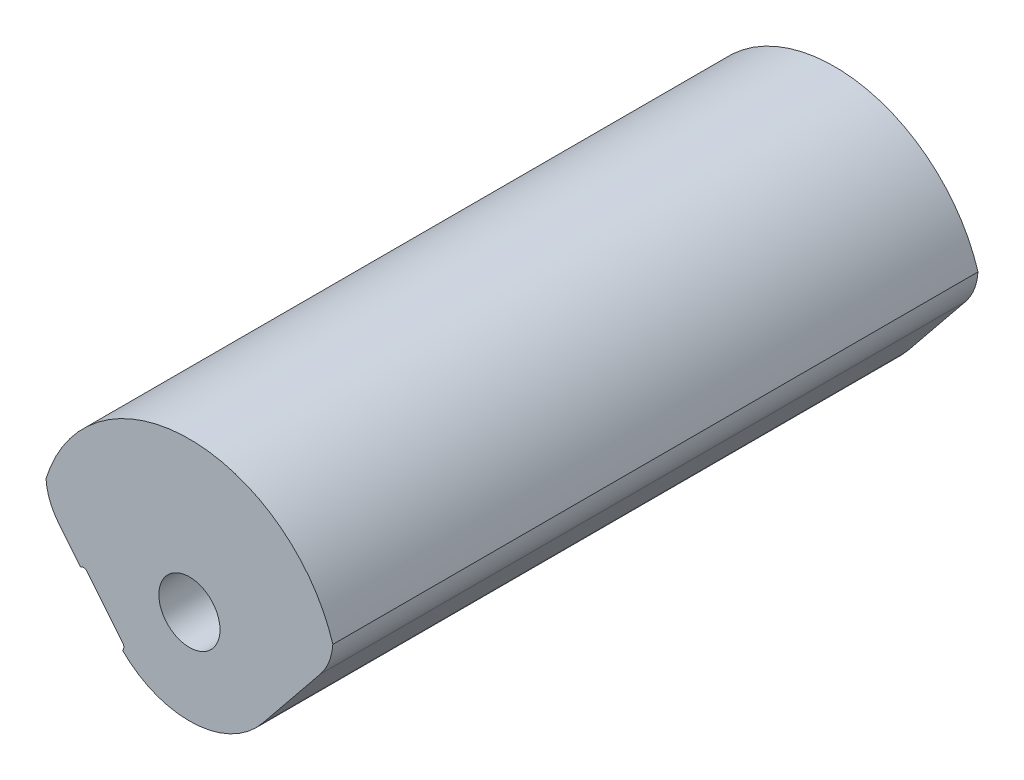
ISO-10303-21;
HEADER;
FILE_DESCRIPTION(('STEP AP214'),'2;1');
FILE_NAME('part.step','',(''),(''),'','','');
FILE_SCHEMA(('AUTOMOTIVE_DESIGN { 1 0 10303 214 1 1 1 1 }'));
ENDSEC;
DATA;
#1=APPLICATION_CONTEXT('core data for automotive mechanical design processes');
#2=APPLICATION_PROTOCOL_DEFINITION('international standard','automotive_design',2000,#1);
#3=PRODUCT_CONTEXT('',#1,'mechanical');
#4=PRODUCT('Part','Part','',(#3));
#5=PRODUCT_RELATED_PRODUCT_CATEGORY('part','',(#4));
#6=PRODUCT_DEFINITION_FORMATION('','',#4);
#7=PRODUCT_DEFINITION_CONTEXT('part definition',#1,'design');
#8=PRODUCT_DEFINITION('design','',#6,#7);
#9=PRODUCT_DEFINITION_SHAPE('','',#8);
#10=(LENGTH_UNIT() NAMED_UNIT(*) SI_UNIT(.MILLI.,.METRE.));
#11=(NAMED_UNIT(*) PLANE_ANGLE_UNIT() SI_UNIT($,.RADIAN.));
#12=(NAMED_UNIT(*) SI_UNIT($,.STERADIAN.) SOLID_ANGLE_UNIT());
#13=UNCERTAINTY_MEASURE_WITH_UNIT(LENGTH_MEASURE(1.E-05),#10,'distance_accuracy_value','');
#14=(GEOMETRIC_REPRESENTATION_CONTEXT(3) GLOBAL_UNCERTAINTY_ASSIGNED_CONTEXT((#13)) GLOBAL_UNIT_ASSIGNED_CONTEXT((#10,
#11,#12)) REPRESENTATION_CONTEXT('',''));
#15=CARTESIAN_POINT('',(0.,0.,0.));
#16=DIRECTION('',(0.,0.,1.));
#17=DIRECTION('',(1.,0.,0.));
#18=AXIS2_PLACEMENT_3D('',#15,#16,#17);
#19=CARTESIAN_POINT('',(0.,0.,8.));
#20=DIRECTION('',(0.,0.,1.));
#21=DIRECTION('',(1.,0.,0.));
#22=AXIS2_PLACEMENT_3D('',#19,#20,#21);
#23=PLANE('',#22);
#24=CARTESIAN_POINT('',(0.,0.,8.));
#25=DIRECTION('',(0.,0.,1.));
#26=DIRECTION('',(1.,0.,0.));
#27=AXIS2_PLACEMENT_3D('',#24,#25,#26);
#28=CIRCLE('',#27,2.5);
#29=CARTESIAN_POINT('',(2.5,0.,8.));
#30=VERTEX_POINT('',#29);
#31=EDGE_CURVE('E20',#30,#30,#28,.F.);
#32=ORIENTED_EDGE('',*,*,#31,.T.);
#33=EDGE_LOOP('',(#32));
#34=FACE_BOUND('',#33,.T.);
#35=ADVANCED_FACE('F17',(#34),#23,.F.);
#36=CARTESIAN_POINT('',(0.,0.,0.));
#37=DIRECTION('',(0.,0.,1.));
#38=DIRECTION('',(1.,0.,0.));
#39=AXIS2_PLACEMENT_3D('',#36,#37,#38);
#40=CYLINDRICAL_SURFACE('',#39,2.5);
#41=ORIENTED_EDGE('',*,*,#31,.F.);
#42=EDGE_LOOP('',(#41));
#43=FACE_BOUND('',#42,.T.);
#44=CARTESIAN_POINT('',(0.,0.,1.2));
#45=DIRECTION('',(0.,0.,1.));
#46=DIRECTION('',(1.,0.,0.));
#47=AXIS2_PLACEMENT_3D('',#44,#45,#46);
#48=CIRCLE('',#47,2.5);
#49=CARTESIAN_POINT('',(2.5,0.,1.2));
#50=VERTEX_POINT('',#49);
#51=EDGE_CURVE('E100',#50,#50,#48,.T.);
#52=ORIENTED_EDGE('',*,*,#51,.F.);
#53=EDGE_LOOP('',(#52));
#54=FACE_BOUND('',#53,.T.);
#55=ADVANCED_FACE('F226',(#43,#54),#40,.F.);
#56=CARTESIAN_POINT('',(0.,0.,1.2));
#57=DIRECTION('',(0.,0.,-1.));
#58=DIRECTION('',(-1.,0.,0.));
#59=AXIS2_PLACEMENT_3D('',#56,#57,#58);
#60=PLANE('',#59);
#61=ORIENTED_EDGE('',*,*,#51,.T.);
#62=EDGE_LOOP('',(#61));
#63=FACE_BOUND('',#62,.T.);
#64=CARTESIAN_POINT('',(0.,0.,1.2));
#65=DIRECTION('',(0.,0.,1.));
#66=DIRECTION('',(1.,0.,0.));
#67=AXIS2_PLACEMENT_3D('',#64,#65,#66);
#68=CIRCLE('',#67,2.75);
#69=CARTESIAN_POINT('',(2.75,0.,1.2));
#70=VERTEX_POINT('',#69);
#71=EDGE_CURVE('E161',#70,#70,#68,.F.);
#72=ORIENTED_EDGE('',*,*,#71,.T.);
#73=EDGE_LOOP('',(#72));
#74=FACE_BOUND('',#73,.T.);
#75=ADVANCED_FACE('F229',(#63,#74),#60,.T.);
#76=CARTESIAN_POINT('',(0.,0.,24.2000000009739));
#77=DIRECTION('',(0.,0.,1.));
#78=DIRECTION('',(1.,0.,0.));
#79=AXIS2_PLACEMENT_3D('',#76,#77,#78);
#80=CONICAL_SURFACE('',#79,1.62099999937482,1.02974425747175);
#81=CARTESIAN_POINT('',(-5.6843418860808E-11,0.,23.2260049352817));
#82=VERTEX_POINT('',#81);
#83=VERTEX_LOOP('',#82);
#84=FACE_BOUND('',#83,.T.);
#85=CARTESIAN_POINT('',(0.,0.,24.2));
#86=DIRECTION('',(0.,0.,1.));
#87=DIRECTION('',(1.,0.,0.));
#88=AXIS2_PLACEMENT_3D('',#85,#86,#87);
#89=CIRCLE('',#88,1.621);
#90=CARTESIAN_POINT('',(1.621,0.,24.2));
#91=VERTEX_POINT('',#90);
#92=EDGE_CURVE('E109',#91,#91,#89,.T.);
#93=ORIENTED_EDGE('',*,*,#92,.T.);
#94=EDGE_LOOP('',(#93));
#95=FACE_BOUND('',#94,.T.);
#96=ADVANCED_FACE('F235',(#84,#95),#80,.F.);
#97=CARTESIAN_POINT('',(-5.61708966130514,-1.0085505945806,0.));
#98=DIRECTION('',(0.,0.,1.));
#99=DIRECTION('',(1.,0.,0.));
#100=AXIS2_PLACEMENT_3D('',#97,#98,#99);
#101=CYLINDRICAL_SURFACE('',#100,0.250000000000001);
#102=DIRECTION('',(0.,0.,1.));
#103=VECTOR('',#102,1.);
#104=CARTESIAN_POINT('',(-5.7744197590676,-0.814264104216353,0.));
#105=LINE('',#104,#103);
#106=CARTESIAN_POINT('',(-5.7744197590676,-0.814264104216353,0.));
#107=VERTEX_POINT('',#106);
#108=CARTESIAN_POINT('',(-5.7744197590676,-0.814264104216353,34.2));
#109=VERTEX_POINT('',#108);
#110=EDGE_CURVE('E103',#107,#109,#105,.T.);
#111=ORIENTED_EDGE('',*,*,#110,.F.);
#112=CARTESIAN_POINT('',(-5.61708966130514,-1.0085505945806,0.));
#113=DIRECTION('',(0.,0.,1.));
#114=DIRECTION('',(1.,0.,0.));
#115=AXIS2_PLACEMENT_3D('',#112,#113,#114);
#116=CIRCLE('',#115,0.250000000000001);
#117=CARTESIAN_POINT('',(-5.4228031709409,-0.851220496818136,0.));
#118=VERTEX_POINT('',#117);
#119=EDGE_CURVE('E88',#118,#107,#116,.T.);
#120=ORIENTED_EDGE('',*,*,#119,.F.);
#121=DIRECTION('',(0.,0.,1.));
#122=VECTOR('',#121,1.);
#123=CARTESIAN_POINT('',(-5.4228031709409,-0.851220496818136,0.));
#124=LINE('',#123,#122);
#125=CARTESIAN_POINT('',(-5.4228031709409,-0.851220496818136,34.2));
#126=VERTEX_POINT('',#125);
#127=EDGE_CURVE('E108',#126,#118,#124,.F.);
#128=ORIENTED_EDGE('',*,*,#127,.F.);
#129=CARTESIAN_POINT('',(-5.61708966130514,-1.0085505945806,34.2));
#130=DIRECTION('',(0.,0.,1.));
#131=DIRECTION('',(1.,0.,0.));
#132=AXIS2_PLACEMENT_3D('',#129,#130,#131);
#133=CIRCLE('',#132,0.250000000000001);
#134=EDGE_CURVE('E99',#109,#126,#133,.F.);
#135=ORIENTED_EDGE('',*,*,#134,.F.);
#136=EDGE_LOOP('',(#111,#120,#128,#135));
#137=FACE_BOUND('',#136,.T.);
#138=ADVANCED_FACE('F104',(#137),#101,.F.);
#139=CARTESIAN_POINT('',(-3.7283997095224,-3.34088844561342,0.));
#140=DIRECTION('',(0.,0.,1.));
#141=DIRECTION('',(1.,0.,0.));
#142=AXIS2_PLACEMENT_3D('',#139,#140,#141);
#143=CYLINDRICAL_SURFACE('',#142,0.250000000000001);
#144=DIRECTION('',(0.,0.,1.));
#145=VECTOR('',#144,1.);
#146=CARTESIAN_POINT('',(-3.53411321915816,-3.18355834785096,0.));
#147=LINE('',#146,#145);
#148=CARTESIAN_POINT('',(-3.53411321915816,-3.18355834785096,0.));
#149=VERTEX_POINT('',#148);
#150=CARTESIAN_POINT('',(-3.53411321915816,-3.18355834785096,34.2));
#151=VERTEX_POINT('',#150);
#152=EDGE_CURVE('E153',#149,#151,#147,.T.);
#153=ORIENTED_EDGE('',*,*,#152,.F.);
#154=CARTESIAN_POINT('',(-3.7283997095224,-3.34088844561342,0.));
#155=DIRECTION('',(0.,0.,1.));
#156=DIRECTION('',(1.,0.,0.));
#157=AXIS2_PLACEMENT_3D('',#154,#155,#156);
#158=CIRCLE('',#157,0.250000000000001);
#159=CARTESIAN_POINT('',(-3.55247410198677,-3.51851215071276,0.));
#160=VERTEX_POINT('',#159);
#161=EDGE_CURVE('E217',#160,#149,#158,.T.);
#162=ORIENTED_EDGE('',*,*,#161,.F.);
#163=DIRECTION('',(0.,0.,1.));
#164=VECTOR('',#163,1.);
#165=CARTESIAN_POINT('',(-3.55247410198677,-3.51851215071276,0.));
#166=LINE('',#165,#164);
#167=CARTESIAN_POINT('',(-3.55247410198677,-3.51851215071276,34.2));
#168=VERTEX_POINT('',#167);
#169=EDGE_CURVE('E150',#168,#160,#166,.F.);
#170=ORIENTED_EDGE('',*,*,#169,.F.);
#171=CARTESIAN_POINT('',(-3.7283997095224,-3.34088844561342,34.2));
#172=DIRECTION('',(0.,0.,1.));
#173=DIRECTION('',(1.,0.,0.));
#174=AXIS2_PLACEMENT_3D('',#171,#172,#173);
#175=CIRCLE('',#174,0.250000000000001);
#176=EDGE_CURVE('E215',#151,#168,#175,.F.);
#177=ORIENTED_EDGE('',*,*,#176,.F.);
#178=EDGE_LOOP('',(#153,#162,#170,#177));
#179=FACE_BOUND('',#178,.T.);
#180=ADVANCED_FACE('F175',(#179),#143,.F.);
#181=CARTESIAN_POINT('',(0.,0.,1.));
#182=DIRECTION('',(0.,0.,-1.));
#183=DIRECTION('',(-1.,0.,0.));
#184=AXIS2_PLACEMENT_3D('',#181,#182,#183);
#185=TOROIDAL_SURFACE('',#184,2.75,0.2);
#186=CARTESIAN_POINT('',(0.,0.,1.));
#187=DIRECTION('',(0.,0.,1.));
#188=DIRECTION('',(1.,0.,0.));
#189=AXIS2_PLACEMENT_3D('',#186,#187,#188);
#190=CIRCLE('',#189,2.95);
#191=CARTESIAN_POINT('',(2.95,0.,1.));
#192=VERTEX_POINT('',#191);
#193=EDGE_CURVE('E139',#192,#192,#190,.F.);
#194=ORIENTED_EDGE('',*,*,#193,.T.);
#195=EDGE_LOOP('',(#194));
#196=FACE_BOUND('',#195,.T.);
#197=ORIENTED_EDGE('',*,*,#71,.F.);
#198=EDGE_LOOP('',(#197));
#199=FACE_BOUND('',#198,.T.);
#200=ADVANCED_FACE('F169',(#196,#199),#185,.F.);
#201=CARTESIAN_POINT('',(4.25,5.1,0.51));
#202=DIRECTION('',(0.,0.,-1.));
#203=DIRECTION('',(-1.,0.,0.));
#204=AXIS2_PLACEMENT_3D('',#201,#202,#203);
#205=PLANE('',#204);
#206=CARTESIAN_POINT('',(4.25,5.1,0.51));
#207=DIRECTION('',(0.,0.,1.));
#208=DIRECTION('',(1.,0.,0.));
#209=AXIS2_PLACEMENT_3D('',#206,#207,#208);
#210=CIRCLE('',#209,0.5);
#211=CARTESIAN_POINT('',(4.75,5.1,0.51));
#212=VERTEX_POINT('',#211);
#213=EDGE_CURVE('E142',#212,#212,#210,.F.);
#214=ORIENTED_EDGE('',*,*,#213,.T.);
#215=EDGE_LOOP('',(#214));
#216=FACE_BOUND('',#215,.T.);
#217=ADVANCED_FACE('F174',(#216),#205,.T.);
#218=CARTESIAN_POINT('',(4.25,-0.7,0.51));
#219=DIRECTION('',(0.,0.,-1.));
#220=DIRECTION('',(-1.,0.,0.));
#221=AXIS2_PLACEMENT_3D('',#218,#219,#220);
#222=PLANE('',#221);
#223=CARTESIAN_POINT('',(4.25,-0.7,0.51));
#224=DIRECTION('',(0.,0.,1.));
#225=DIRECTION('',(1.,0.,0.));
#226=AXIS2_PLACEMENT_3D('',#223,#224,#225);
#227=CIRCLE('',#226,0.5);
#228=CARTESIAN_POINT('',(4.75,-0.7,0.51));
#229=VERTEX_POINT('',#228);
#230=EDGE_CURVE('E158',#229,#229,#227,.F.);
#231=ORIENTED_EDGE('',*,*,#230,.T.);
#232=EDGE_LOOP('',(#231));
#233=FACE_BOUND('',#232,.T.);
#234=ADVANCED_FACE('F286',(#233),#222,.T.);
#235=CARTESIAN_POINT('',(0.,0.,29.2));
#236=DIRECTION('',(0.,0.,1.));
#237=DIRECTION('',(1.,0.,0.));
#238=AXIS2_PLACEMENT_3D('',#235,#236,#237);
#239=CYLINDRICAL_SURFACE('',#238,1.621);
#240=ORIENTED_EDGE('',*,*,#92,.F.);
#241=EDGE_LOOP('',(#240));
#242=FACE_BOUND('',#241,.T.);
#243=CARTESIAN_POINT('',(0.,0.,34.2));
#244=DIRECTION('',(0.,0.,1.));
#245=DIRECTION('',(1.,0.,0.));
#246=AXIS2_PLACEMENT_3D('',#243,#244,#245);
#247=CIRCLE('',#246,1.621);
#248=CARTESIAN_POINT('',(1.621,0.,34.2));
#249=VERTEX_POINT('',#248);
#250=EDGE_CURVE('E131',#249,#249,#247,.F.);
#251=ORIENTED_EDGE('',*,*,#250,.F.);
#252=EDGE_LOOP('',(#251));
#253=FACE_BOUND('',#252,.T.);
#254=ADVANCED_FACE('F284',(#242,#253),#239,.F.);
#255=CARTESIAN_POINT('',(-5.7744197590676,-0.814264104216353,0.));
#256=DIRECTION('',(-0.77714596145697,-0.629320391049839,0.));
#257=DIRECTION('',(0.629320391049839,-0.77714596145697,0.));
#258=AXIS2_PLACEMENT_3D('',#255,#256,#257);
#259=PLANE('',#258);
#260=DIRECTION('',(0.629320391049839,-0.77714596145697,0.));
#261=VECTOR('',#260,1.);
#262=CARTESIAN_POINT('',(-6.94052773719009,0.625759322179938,0.));
#263=LINE('',#262,#261);
#264=CARTESIAN_POINT('',(-6.94052773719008,0.625759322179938,0.));
#265=VERTEX_POINT('',#264);
#266=EDGE_CURVE('E96',#265,#107,#263,.T.);
#267=ORIENTED_EDGE('',*,*,#266,.T.);
#268=ORIENTED_EDGE('',*,*,#110,.T.);
#269=DIRECTION('',(0.629320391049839,-0.77714596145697,0.));
#270=VECTOR('',#269,1.);
#271=CARTESIAN_POINT('',(-6.94052773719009,0.625759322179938,34.2));
#272=LINE('',#271,#270);
#273=CARTESIAN_POINT('',(-6.94052773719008,0.625759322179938,34.2));
#274=VERTEX_POINT('',#273);
#275=EDGE_CURVE('E136',#274,#109,#272,.T.);
#276=ORIENTED_EDGE('',*,*,#275,.F.);
#277=DIRECTION('',(0.,0.,1.));
#278=VECTOR('',#277,1.);
#279=CARTESIAN_POINT('',(-6.94052773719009,0.625759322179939,0.));
#280=LINE('',#279,#278);
#281=EDGE_CURVE('E112',#265,#274,#280,.T.);
#282=ORIENTED_EDGE('',*,*,#281,.F.);
#283=EDGE_LOOP('',(#267,#268,#276,#282));
#284=FACE_BOUND('',#283,.T.);
#285=ADVANCED_FACE('F111',(#284),#259,.T.);
#286=CARTESIAN_POINT('',(-3.53411321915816,-3.18355834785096,0.));
#287=DIRECTION('',(-0.77714596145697,-0.629320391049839,0.));
#288=DIRECTION('',(0.629320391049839,-0.77714596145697,0.));
#289=AXIS2_PLACEMENT_3D('',#286,#287,#288);
#290=PLANE('',#289);
#291=DIRECTION('',(0.629320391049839,-0.77714596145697,0.));
#292=VECTOR('',#291,1.);
#293=CARTESIAN_POINT('',(-5.4228031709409,-0.851220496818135,0.));
#294=LINE('',#293,#292);
#295=EDGE_CURVE('E98',#118,#149,#294,.T.);
#296=ORIENTED_EDGE('',*,*,#295,.T.);
#297=ORIENTED_EDGE('',*,*,#152,.T.);
#298=DIRECTION('',(0.629320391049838,-0.77714596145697,0.));
#299=VECTOR('',#298,1.);
#300=CARTESIAN_POINT('',(-5.4228031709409,-0.851220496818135,34.2));
#301=LINE('',#300,#299);
#302=EDGE_CURVE('E133',#126,#151,#301,.T.);
#303=ORIENTED_EDGE('',*,*,#302,.F.);
#304=ORIENTED_EDGE('',*,*,#127,.T.);
#305=EDGE_LOOP('',(#296,#297,#303,#304));
#306=FACE_BOUND('',#305,.T.);
#307=ADVANCED_FACE('F277',(#306),#290,.T.);
#308=CARTESIAN_POINT('',(0.,0.,0.));
#309=DIRECTION('',(0.,0.,1.));
#310=DIRECTION('',(1.,0.,0.));
#311=AXIS2_PLACEMENT_3D('',#308,#309,#310);
#312=CYLINDRICAL_SURFACE('',#311,5.);
#313=CARTESIAN_POINT('',(0.,0.,0.));
#314=DIRECTION('',(0.,0.,1.));
#315=DIRECTION('',(1.,0.,0.));
#316=AXIS2_PLACEMENT_3D('',#313,#314,#315);
#317=CIRCLE('',#316,5.);
#318=CARTESIAN_POINT('',(3.88572980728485,-3.14660195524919,0.));
#319=VERTEX_POINT('',#318);
#320=EDGE_CURVE('E116',#160,#319,#317,.T.);
#321=ORIENTED_EDGE('',*,*,#320,.T.);
#322=DIRECTION('',(0.,0.,1.));
#323=VECTOR('',#322,1.);
#324=CARTESIAN_POINT('',(3.88572980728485,-3.14660195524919,0.));
#325=LINE('',#324,#323);
#326=CARTESIAN_POINT('',(3.88572980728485,-3.14660195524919,34.2));
#327=VERTEX_POINT('',#326);
#328=EDGE_CURVE('E143',#327,#319,#325,.F.);
#329=ORIENTED_EDGE('',*,*,#328,.F.);
#330=CARTESIAN_POINT('',(0.,0.,34.2));
#331=DIRECTION('',(0.,0.,1.));
#332=DIRECTION('',(1.,0.,0.));
#333=AXIS2_PLACEMENT_3D('',#330,#331,#332);
#334=CIRCLE('',#333,5.);
#335=EDGE_CURVE('E132',#168,#327,#334,.T.);
#336=ORIENTED_EDGE('',*,*,#335,.F.);
#337=ORIENTED_EDGE('',*,*,#169,.T.);
#338=EDGE_LOOP('',(#321,#329,#336,#337));
#339=FACE_BOUND('',#338,.T.);
#340=ADVANCED_FACE('F273',(#339),#312,.T.);
#341=CARTESIAN_POINT('',(6.94052773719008,0.625759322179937,0.));
#342=DIRECTION('',(0.777145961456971,-0.629320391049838,0.));
#343=DIRECTION('',(0.629320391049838,0.777145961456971,0.));
#344=AXIS2_PLACEMENT_3D('',#341,#342,#343);
#345=PLANE('',#344);
#346=DIRECTION('',(0.629320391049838,0.777145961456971,0.));
#347=VECTOR('',#346,1.);
#348=CARTESIAN_POINT('',(3.88572980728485,-3.14660195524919,0.));
#349=LINE('',#348,#347);
#350=CARTESIAN_POINT('',(6.94052773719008,0.625759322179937,0.));
#351=VERTEX_POINT('',#350);
#352=EDGE_CURVE('E201',#319,#351,#349,.T.);
#353=ORIENTED_EDGE('',*,*,#352,.T.);
#354=DIRECTION('',(0.,0.,1.));
#355=VECTOR('',#354,1.);
#356=CARTESIAN_POINT('',(6.94052773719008,0.625759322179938,0.));
#357=LINE('',#356,#355);
#358=CARTESIAN_POINT('',(6.94052773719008,0.625759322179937,34.2));
#359=VERTEX_POINT('',#358);
#360=EDGE_CURVE('E118',#359,#351,#357,.F.);
#361=ORIENTED_EDGE('',*,*,#360,.F.);
#362=DIRECTION('',(0.629320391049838,0.777145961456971,0.));
#363=VECTOR('',#362,1.);
#364=CARTESIAN_POINT('',(3.88572980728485,-3.14660195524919,34.2));
#365=LINE('',#364,#363);
#366=EDGE_CURVE('E129',#327,#359,#365,.T.);
#367=ORIENTED_EDGE('',*,*,#366,.F.);
#368=ORIENTED_EDGE('',*,*,#328,.T.);
#369=EDGE_LOOP('',(#353,#361,#367,#368));
#370=FACE_BOUND('',#369,.T.);
#371=ADVANCED_FACE('F269',(#370),#345,.T.);
#372=CARTESIAN_POINT('',(0.,0.,0.));
#373=DIRECTION('',(0.,0.,1.));
#374=DIRECTION('',(1.,0.,0.));
#375=AXIS2_PLACEMENT_3D('',#372,#373,#374);
#376=CYLINDRICAL_SURFACE('',#375,2.95);
#377=ORIENTED_EDGE('',*,*,#193,.F.);
#378=EDGE_LOOP('',(#377));
#379=FACE_BOUND('',#378,.T.);
#380=CARTESIAN_POINT('',(0.,0.,0.));
#381=DIRECTION('',(0.,0.,1.));
#382=DIRECTION('',(1.,0.,0.));
#383=AXIS2_PLACEMENT_3D('',#380,#381,#382);
#384=CIRCLE('',#383,2.95);
#385=CARTESIAN_POINT('',(2.95,0.,0.));
#386=VERTEX_POINT('',#385);
#387=EDGE_CURVE('E197',#386,#386,#384,.F.);
#388=ORIENTED_EDGE('',*,*,#387,.T.);
#389=EDGE_LOOP('',(#388));
#390=FACE_BOUND('',#389,.T.);
#391=ADVANCED_FACE('F265',(#379,#390),#376,.F.);
#392=CARTESIAN_POINT('',(4.25,5.1,0.));
#393=DIRECTION('',(0.,0.,1.));
#394=DIRECTION('',(1.,0.,0.));
#395=AXIS2_PLACEMENT_3D('',#392,#393,#394);
#396=CYLINDRICAL_SURFACE('',#395,0.5);
#397=CARTESIAN_POINT('',(4.25,5.1,0.));
#398=DIRECTION('',(0.,0.,1.));
#399=DIRECTION('',(1.,0.,0.));
#400=AXIS2_PLACEMENT_3D('',#397,#398,#399);
#401=CIRCLE('',#400,0.5);
#402=CARTESIAN_POINT('',(4.75,5.1,0.));
#403=VERTEX_POINT('',#402);
#404=EDGE_CURVE('E194',#403,#403,#401,.F.);
#405=ORIENTED_EDGE('',*,*,#404,.T.);
#406=EDGE_LOOP('',(#405));
#407=FACE_BOUND('',#406,.T.);
#408=ORIENTED_EDGE('',*,*,#213,.F.);
#409=EDGE_LOOP('',(#408));
#410=FACE_BOUND('',#409,.T.);
#411=ADVANCED_FACE('F261',(#407,#410),#396,.F.);
#412=CARTESIAN_POINT('',(4.25,-0.7,0.));
#413=DIRECTION('',(0.,0.,1.));
#414=DIRECTION('',(1.,0.,0.));
#415=AXIS2_PLACEMENT_3D('',#412,#413,#414);
#416=CYLINDRICAL_SURFACE('',#415,0.5);
#417=CARTESIAN_POINT('',(4.25,-0.7,0.));
#418=DIRECTION('',(0.,0.,1.));
#419=DIRECTION('',(1.,0.,0.));
#420=AXIS2_PLACEMENT_3D('',#417,#418,#419);
#421=CIRCLE('',#420,0.5);
#422=CARTESIAN_POINT('',(4.75,-0.7,0.));
#423=VERTEX_POINT('',#422);
#424=EDGE_CURVE('E128',#423,#423,#421,.F.);
#425=ORIENTED_EDGE('',*,*,#424,.T.);
#426=EDGE_LOOP('',(#425));
#427=FACE_BOUND('',#426,.T.);
#428=ORIENTED_EDGE('',*,*,#230,.F.);
#429=EDGE_LOOP('',(#428));
#430=FACE_BOUND('',#429,.T.);
#431=ADVANCED_FACE('F257',(#427,#430),#416,.F.);
#432=CARTESIAN_POINT('',(-4.60908985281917,2.51372049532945,0.));
#433=DIRECTION('',(0.,0.,1.));
#434=DIRECTION('',(1.,0.,0.));
#435=AXIS2_PLACEMENT_3D('',#432,#433,#434);
#436=CYLINDRICAL_SURFACE('',#435,3.);
#437=CARTESIAN_POINT('',(-4.60908985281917,2.51372049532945,0.));
#438=DIRECTION('',(0.,0.,1.));
#439=DIRECTION('',(1.,0.,0.));
#440=AXIS2_PLACEMENT_3D('',#437,#438,#439);
#441=CIRCLE('',#440,3.);
#442=CARTESIAN_POINT('',(-7.60302402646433,2.32304232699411,0.));
#443=VERTEX_POINT('',#442);
#444=EDGE_CURVE('E114',#443,#265,#441,.T.);
#445=ORIENTED_EDGE('',*,*,#444,.T.);
#446=ORIENTED_EDGE('',*,*,#281,.T.);
#447=CARTESIAN_POINT('',(-4.60908985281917,2.51372049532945,34.2));
#448=DIRECTION('',(0.,0.,1.));
#449=DIRECTION('',(1.,0.,0.));
#450=AXIS2_PLACEMENT_3D('',#447,#448,#449);
#451=CIRCLE('',#450,3.);
#452=CARTESIAN_POINT('',(-7.60302402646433,2.32304232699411,34.2));
#453=VERTEX_POINT('',#452);
#454=EDGE_CURVE('E138',#453,#274,#451,.T.);
#455=ORIENTED_EDGE('',*,*,#454,.F.);
#456=DIRECTION('',(0.,0.,1.));
#457=VECTOR('',#456,1.);
#458=CARTESIAN_POINT('',(-7.60302402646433,2.32304232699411,0.));
#459=LINE('',#458,#457);
#460=EDGE_CURVE('E125',#443,#453,#459,.T.);
#461=ORIENTED_EDGE('',*,*,#460,.F.);
#462=EDGE_LOOP('',(#445,#446,#455,#461));
#463=FACE_BOUND('',#462,.T.);
#464=ADVANCED_FACE('F253',(#463),#436,.T.);
#465=CARTESIAN_POINT('',(0.,1.475,34.2));
#466=DIRECTION('',(0.,0.,1.));
#467=DIRECTION('',(1.,0.,0.));
#468=AXIS2_PLACEMENT_3D('',#465,#466,#467);
#469=PLANE('',#468);
#470=ORIENTED_EDGE('',*,*,#250,.T.);
#471=EDGE_LOOP('',(#470));
#472=FACE_BOUND('',#471,.T.);
#473=ORIENTED_EDGE('',*,*,#335,.T.);
#474=ORIENTED_EDGE('',*,*,#366,.T.);
#475=CARTESIAN_POINT('',(4.60908985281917,2.51372049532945,34.2));
#476=DIRECTION('',(0.,0.,1.));
#477=DIRECTION('',(1.,0.,0.));
#478=AXIS2_PLACEMENT_3D('',#475,#476,#477);
#479=CIRCLE('',#478,3.);
#480=CARTESIAN_POINT('',(7.60302402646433,2.32304232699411,34.2));
#481=VERTEX_POINT('',#480);
#482=EDGE_CURVE('E147',#481,#359,#479,.F.);
#483=ORIENTED_EDGE('',*,*,#482,.F.);
#484=CARTESIAN_POINT('',(0.,0.,34.2));
#485=DIRECTION('',(0.,0.,1.));
#486=DIRECTION('',(1.,0.,0.));
#487=AXIS2_PLACEMENT_3D('',#484,#485,#486);
#488=CIRCLE('',#487,7.95);
#489=EDGE_CURVE('E124',#453,#481,#488,.F.);
#490=ORIENTED_EDGE('',*,*,#489,.F.);
#491=ORIENTED_EDGE('',*,*,#454,.T.);
#492=ORIENTED_EDGE('',*,*,#275,.T.);
#493=ORIENTED_EDGE('',*,*,#134,.T.);
#494=ORIENTED_EDGE('',*,*,#302,.T.);
#495=ORIENTED_EDGE('',*,*,#176,.T.);
#496=EDGE_LOOP('',(#473,#474,#483,#490,#491,#492,#493,#494,#495));
#497=FACE_BOUND('',#496,.T.);
#498=ADVANCED_FACE('F250',(#472,#497),#469,.T.);
#499=CARTESIAN_POINT('',(4.60908985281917,2.51372049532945,0.));
#500=DIRECTION('',(0.,0.,1.));
#501=DIRECTION('',(1.,0.,0.));
#502=AXIS2_PLACEMENT_3D('',#499,#500,#501);
#503=CYLINDRICAL_SURFACE('',#502,3.);
#504=CARTESIAN_POINT('',(4.60908985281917,2.51372049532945,0.));
#505=DIRECTION('',(0.,0.,1.));
#506=DIRECTION('',(1.,0.,0.));
#507=AXIS2_PLACEMENT_3D('',#504,#505,#506);
#508=CIRCLE('',#507,3.);
#509=CARTESIAN_POINT('',(7.60302402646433,2.32304232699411,0.));
#510=VERTEX_POINT('',#509);
#511=EDGE_CURVE('E35',#351,#510,#508,.T.);
#512=ORIENTED_EDGE('',*,*,#511,.T.);
#513=DIRECTION('',(0.,0.,1.));
#514=VECTOR('',#513,1.);
#515=CARTESIAN_POINT('',(7.60302402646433,2.32304232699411,0.));
#516=LINE('',#515,#514);
#517=EDGE_CURVE('E26',#481,#510,#516,.F.);
#518=ORIENTED_EDGE('',*,*,#517,.F.);
#519=ORIENTED_EDGE('',*,*,#482,.T.);
#520=ORIENTED_EDGE('',*,*,#360,.T.);
#521=EDGE_LOOP('',(#512,#518,#519,#520));
#522=FACE_BOUND('',#521,.T.);
#523=ADVANCED_FACE('F244',(#522),#503,.T.);
#524=CARTESIAN_POINT('',(-0.014394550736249,1.6052860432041,0.));
#525=DIRECTION('',(0.,0.,1.));
#526=DIRECTION('',(1.,0.,0.));
#527=AXIS2_PLACEMENT_3D('',#524,#525,#526);
#528=PLANE('',#527);
#529=ORIENTED_EDGE('',*,*,#424,.F.);
#530=EDGE_LOOP('',(#529));
#531=FACE_BOUND('',#530,.T.);
#532=ORIENTED_EDGE('',*,*,#404,.F.);
#533=EDGE_LOOP('',(#532));
#534=FACE_BOUND('',#533,.T.);
#535=ORIENTED_EDGE('',*,*,#387,.F.);
#536=EDGE_LOOP('',(#535));
#537=FACE_BOUND('',#536,.T.);
#538=ORIENTED_EDGE('',*,*,#511,.F.);
#539=ORIENTED_EDGE('',*,*,#352,.F.);
#540=ORIENTED_EDGE('',*,*,#320,.F.);
#541=ORIENTED_EDGE('',*,*,#161,.T.);
#542=ORIENTED_EDGE('',*,*,#295,.F.);
#543=ORIENTED_EDGE('',*,*,#119,.T.);
#544=ORIENTED_EDGE('',*,*,#266,.F.);
#545=ORIENTED_EDGE('',*,*,#444,.F.);
#546=CARTESIAN_POINT('',(0.,0.,0.));
#547=DIRECTION('',(0.,0.,1.));
#548=DIRECTION('',(1.,0.,0.));
#549=AXIS2_PLACEMENT_3D('',#546,#547,#548);
#550=CIRCLE('',#549,7.95);
#551=EDGE_CURVE('E11',#510,#443,#550,.T.);
#552=ORIENTED_EDGE('',*,*,#551,.F.);
#553=EDGE_LOOP('',(#538,#539,#540,#541,#542,#543,#544,#545,#552));
#554=FACE_BOUND('',#553,.T.);
#555=ADVANCED_FACE('F93',(#531,#534,#537,#554),#528,.F.);
#556=CARTESIAN_POINT('',(0.,0.,0.));
#557=DIRECTION('',(0.,0.,1.));
#558=DIRECTION('',(1.,0.,0.));
#559=AXIS2_PLACEMENT_3D('',#556,#557,#558);
#560=CYLINDRICAL_SURFACE('',#559,7.95);
#561=ORIENTED_EDGE('',*,*,#517,.T.);
#562=ORIENTED_EDGE('',*,*,#551,.T.);
#563=ORIENTED_EDGE('',*,*,#460,.T.);
#564=ORIENTED_EDGE('',*,*,#489,.T.);
#565=EDGE_LOOP('',(#561,#562,#563,#564));
#566=FACE_BOUND('',#565,.T.);
#567=ADVANCED_FACE('F237',(#566),#560,.T.);
#568=CLOSED_SHELL('',(#35,#55,#75,#96,#138,#180,#200,#217,#234,#254,#285,#307,#340,#371,#391,
#411,#431,#464,#498,#523,#555,#567));
#569=MANIFOLD_SOLID_BREP('B1',#568);
#570=ADVANCED_BREP_SHAPE_REPRESENTATION('',(#18,#569),#14);
#571=SHAPE_DEFINITION_REPRESENTATION(#9,#570);
ENDSEC;
END-ISO-10303-21;
